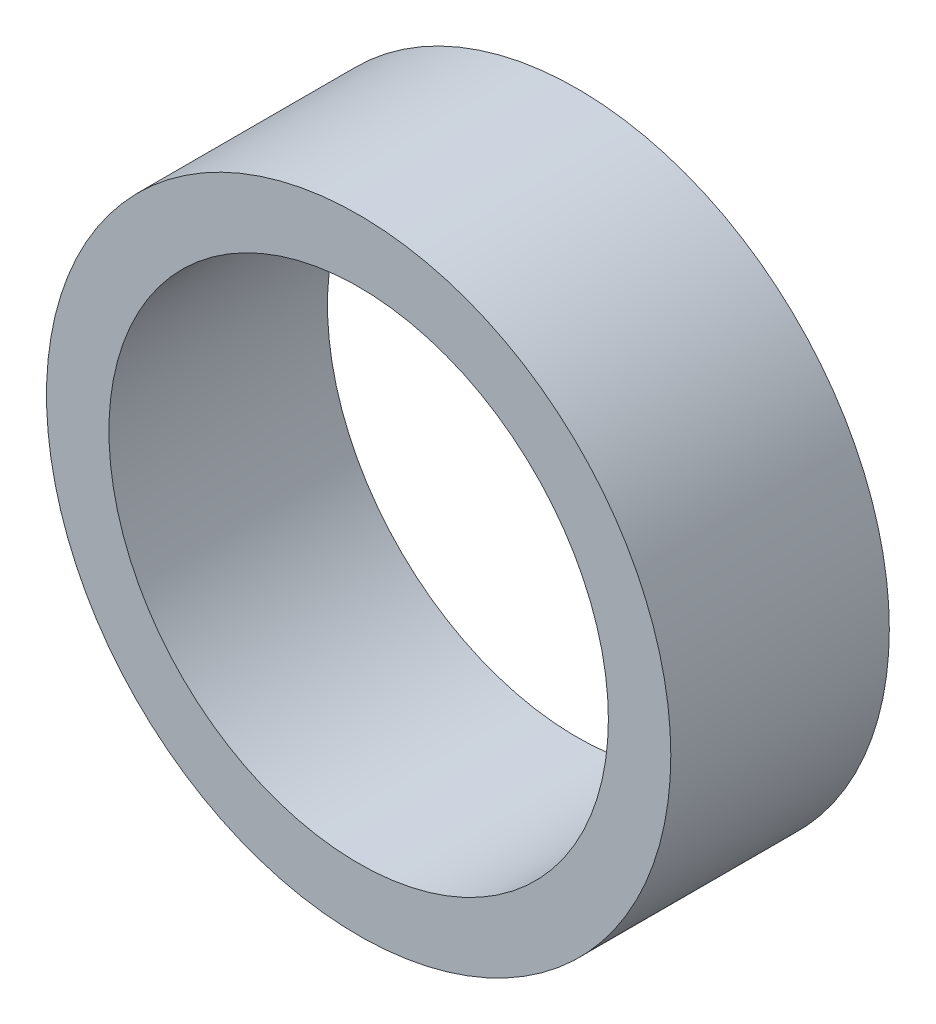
ISO-10303-21;
HEADER;
FILE_DESCRIPTION(('STEP AP214'),'2;1');
FILE_NAME('part.step','',(''),(''),'','','');
FILE_SCHEMA(('AUTOMOTIVE_DESIGN { 1 0 10303 214 1 1 1 1 }'));
ENDSEC;
DATA;
#1=APPLICATION_CONTEXT('core data for automotive mechanical design processes');
#2=APPLICATION_PROTOCOL_DEFINITION('international standard','automotive_design',2000,#1);
#3=PRODUCT_CONTEXT('',#1,'mechanical');
#4=PRODUCT('Part','Part','',(#3));
#5=PRODUCT_RELATED_PRODUCT_CATEGORY('part','',(#4));
#6=PRODUCT_DEFINITION_FORMATION('','',#4);
#7=PRODUCT_DEFINITION_CONTEXT('part definition',#1,'design');
#8=PRODUCT_DEFINITION('design','',#6,#7);
#9=PRODUCT_DEFINITION_SHAPE('','',#8);
#10=(LENGTH_UNIT() NAMED_UNIT(*) SI_UNIT(.MILLI.,.METRE.));
#11=(NAMED_UNIT(*) PLANE_ANGLE_UNIT() SI_UNIT($,.RADIAN.));
#12=(NAMED_UNIT(*) SI_UNIT($,.STERADIAN.) SOLID_ANGLE_UNIT());
#13=UNCERTAINTY_MEASURE_WITH_UNIT(LENGTH_MEASURE(1.E-05),#10,'distance_accuracy_value','');
#14=(GEOMETRIC_REPRESENTATION_CONTEXT(3) GLOBAL_UNCERTAINTY_ASSIGNED_CONTEXT((#13)) GLOBAL_UNIT_ASSIGNED_CONTEXT((#10,
#11,#12)) REPRESENTATION_CONTEXT('',''));
#15=CARTESIAN_POINT('',(0.,0.,0.));
#16=DIRECTION('',(0.,0.,1.));
#17=DIRECTION('',(1.,0.,0.));
#18=AXIS2_PLACEMENT_3D('',#15,#16,#17);
#19=CARTESIAN_POINT('',(0.,0.,3.5));
#20=DIRECTION('',(0.,0.,1.));
#21=DIRECTION('',(1.,0.,0.));
#22=AXIS2_PLACEMENT_3D('',#19,#20,#21);
#23=PLANE('',#22);
#24=CARTESIAN_POINT('',(0.,0.,3.5));
#25=DIRECTION('',(0.,0.,1.));
#26=DIRECTION('',(1.,0.,0.));
#27=AXIS2_PLACEMENT_3D('',#24,#25,#26);
#28=CIRCLE('',#27,5.);
#29=CARTESIAN_POINT('',(5.,0.,3.5));
#30=VERTEX_POINT('',#29);
#31=EDGE_CURVE('E10',#30,#30,#28,.T.);
#32=ORIENTED_EDGE('',*,*,#31,.T.);
#33=EDGE_LOOP('',(#32));
#34=FACE_BOUND('',#33,.T.);
#35=CARTESIAN_POINT('',(0.,0.,3.5));
#36=DIRECTION('',(0.,0.,1.));
#37=DIRECTION('',(1.,0.,0.));
#38=AXIS2_PLACEMENT_3D('',#35,#36,#37);
#39=CIRCLE('',#38,4.);
#40=CARTESIAN_POINT('',(4.,0.,3.5));
#41=VERTEX_POINT('',#40);
#42=EDGE_CURVE('E42',#41,#41,#39,.T.);
#43=ORIENTED_EDGE('',*,*,#42,.F.);
#44=EDGE_LOOP('',(#43));
#45=FACE_BOUND('',#44,.T.);
#46=ADVANCED_FACE('F31',(#34,#45),#23,.T.);
#47=CARTESIAN_POINT('',(0.,0.,0.));
#48=DIRECTION('',(0.,0.,1.));
#49=DIRECTION('',(1.,0.,0.));
#50=AXIS2_PLACEMENT_3D('',#47,#48,#49);
#51=PLANE('',#50);
#52=CARTESIAN_POINT('',(0.,0.,0.));
#53=DIRECTION('',(0.,0.,1.));
#54=DIRECTION('',(1.,0.,0.));
#55=AXIS2_PLACEMENT_3D('',#52,#53,#54);
#56=CIRCLE('',#55,5.);
#57=CARTESIAN_POINT('',(5.,0.,0.));
#58=VERTEX_POINT('',#57);
#59=EDGE_CURVE('E35',#58,#58,#56,.T.);
#60=ORIENTED_EDGE('',*,*,#59,.F.);
#61=EDGE_LOOP('',(#60));
#62=FACE_BOUND('',#61,.T.);
#63=CARTESIAN_POINT('',(0.,0.,0.));
#64=DIRECTION('',(0.,0.,1.));
#65=DIRECTION('',(1.,0.,0.));
#66=AXIS2_PLACEMENT_3D('',#63,#64,#65);
#67=CIRCLE('',#66,4.);
#68=CARTESIAN_POINT('',(4.,0.,0.));
#69=VERTEX_POINT('',#68);
#70=EDGE_CURVE('E44',#69,#69,#67,.T.);
#71=ORIENTED_EDGE('',*,*,#70,.T.);
#72=EDGE_LOOP('',(#71));
#73=FACE_BOUND('',#72,.T.);
#74=ADVANCED_FACE('F54',(#62,#73),#51,.F.);
#75=CARTESIAN_POINT('',(0.,0.,3.5));
#76=DIRECTION('',(0.,0.,-1.));
#77=DIRECTION('',(-1.,0.,0.));
#78=AXIS2_PLACEMENT_3D('',#75,#76,#77);
#79=CYLINDRICAL_SURFACE('',#78,5.);
#80=ORIENTED_EDGE('',*,*,#31,.F.);
#81=EDGE_LOOP('',(#80));
#82=FACE_BOUND('',#81,.T.);
#83=ORIENTED_EDGE('',*,*,#59,.T.);
#84=EDGE_LOOP('',(#83));
#85=FACE_BOUND('',#84,.T.);
#86=ADVANCED_FACE('F33',(#82,#85),#79,.T.);
#87=CARTESIAN_POINT('',(0.,0.,3.5));
#88=DIRECTION('',(0.,0.,-1.));
#89=DIRECTION('',(-1.,0.,0.));
#90=AXIS2_PLACEMENT_3D('',#87,#88,#89);
#91=CYLINDRICAL_SURFACE('',#90,4.);
#92=ORIENTED_EDGE('',*,*,#42,.T.);
#93=EDGE_LOOP('',(#92));
#94=FACE_BOUND('',#93,.T.);
#95=ORIENTED_EDGE('',*,*,#70,.F.);
#96=EDGE_LOOP('',(#95));
#97=FACE_BOUND('',#96,.T.);
#98=ADVANCED_FACE('F50',(#94,#97),#91,.F.);
#99=CLOSED_SHELL('',(#46,#74,#86,#98));
#100=MANIFOLD_SOLID_BREP('B2',#99);
#101=ADVANCED_BREP_SHAPE_REPRESENTATION('',(#18,#100),#14);
#102=SHAPE_DEFINITION_REPRESENTATION(#9,#101);
ENDSEC;
END-ISO-10303-21;
